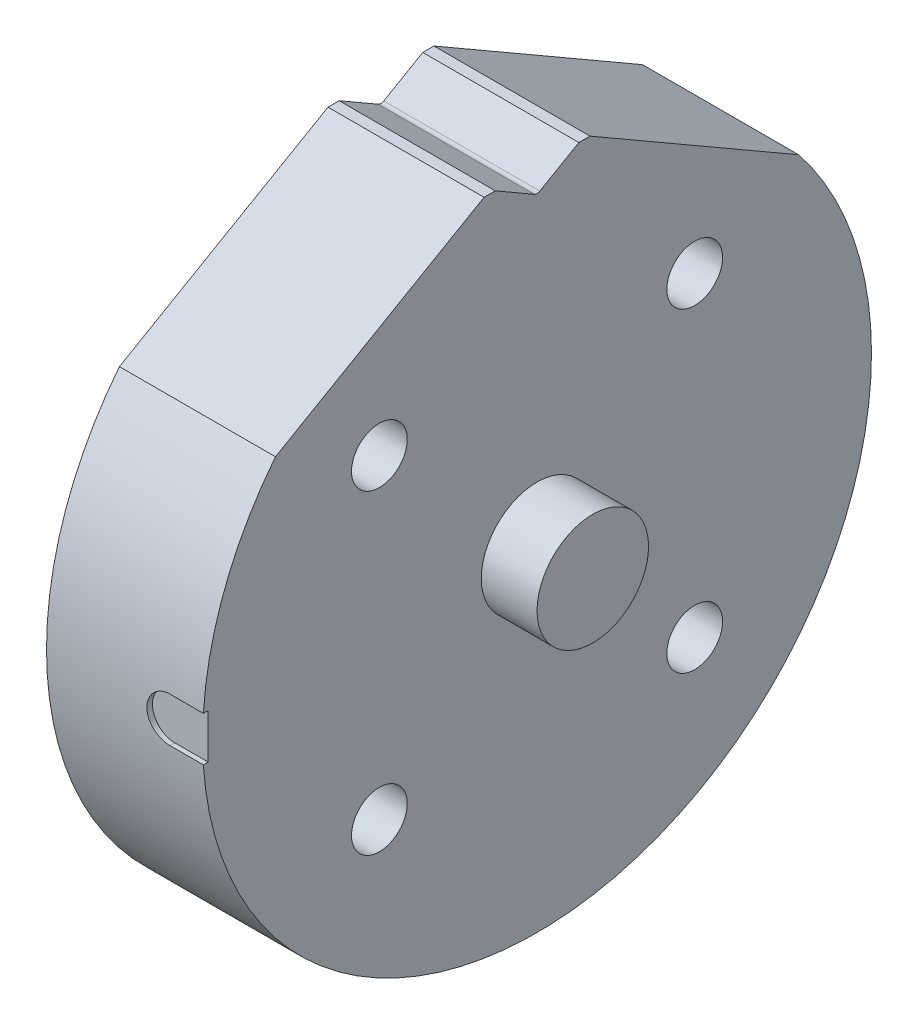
ISO-10303-21;
HEADER;
FILE_DESCRIPTION(('STEP AP214'),'2;1');
FILE_NAME('part.step','',(''),(''),'','','');
FILE_SCHEMA(('AUTOMOTIVE_DESIGN { 1 0 10303 214 1 1 1 1 }'));
ENDSEC;
DATA;
#1=APPLICATION_CONTEXT('core data for automotive mechanical design processes');
#2=APPLICATION_PROTOCOL_DEFINITION('international standard','automotive_design',2000,#1);
#3=PRODUCT_CONTEXT('',#1,'mechanical');
#4=PRODUCT('Part','Part','',(#3));
#5=PRODUCT_RELATED_PRODUCT_CATEGORY('part','',(#4));
#6=PRODUCT_DEFINITION_FORMATION('','',#4);
#7=PRODUCT_DEFINITION_CONTEXT('part definition',#1,'design');
#8=PRODUCT_DEFINITION('design','',#6,#7);
#9=PRODUCT_DEFINITION_SHAPE('','',#8);
#10=(LENGTH_UNIT() NAMED_UNIT(*) SI_UNIT(.MILLI.,.METRE.));
#11=(NAMED_UNIT(*) PLANE_ANGLE_UNIT() SI_UNIT($,.RADIAN.));
#12=(NAMED_UNIT(*) SI_UNIT($,.STERADIAN.) SOLID_ANGLE_UNIT());
#13=UNCERTAINTY_MEASURE_WITH_UNIT(LENGTH_MEASURE(1.E-05),#10,'distance_accuracy_value','');
#14=(GEOMETRIC_REPRESENTATION_CONTEXT(3) GLOBAL_UNCERTAINTY_ASSIGNED_CONTEXT((#13)) GLOBAL_UNIT_ASSIGNED_CONTEXT((#10,
#11,#12)) REPRESENTATION_CONTEXT('',''));
#15=CARTESIAN_POINT('',(0.,0.,0.));
#16=DIRECTION('',(0.,0.,1.));
#17=DIRECTION('',(1.,0.,0.));
#18=AXIS2_PLACEMENT_3D('',#15,#16,#17);
#19=CARTESIAN_POINT('',(-63.0638210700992,-1.66533453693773E-13,0.));
#20=DIRECTION('',(-1.,0.,0.));
#21=DIRECTION('',(0.,0.,1.));
#22=AXIS2_PLACEMENT_3D('',#19,#20,#21);
#23=CYLINDRICAL_SURFACE('',#22,30.);
#24=CARTESIAN_POINT('',(7.,-29.3938769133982,-6.));
#25=CARTESIAN_POINT('',(7.16674913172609,-29.3938750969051,-6.00000333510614));
#26=CARTESIAN_POINT('',(7.33345662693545,-29.3952984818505,-5.99304686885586));
#27=CARTESIAN_POINT('',(7.66571638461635,-29.4009458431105,-5.96528300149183));
#28=CARTESIAN_POINT('',(7.83126844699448,-29.4051702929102,-5.94447325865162));
#29=CARTESIAN_POINT('',(8.16005695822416,-29.416300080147,-5.88914931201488));
#30=CARTESIAN_POINT('',(8.32329215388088,-29.4232068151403,-5.85462796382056));
#31=CARTESIAN_POINT('',(8.64626671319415,-29.4395002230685,-5.77213943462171));
#32=CARTESIAN_POINT('',(8.80600476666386,-29.4488878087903,-5.72416730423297));
#33=CARTESIAN_POINT('',(9.12058736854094,-29.4698539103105,-5.61522748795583));
#34=CARTESIAN_POINT('',(9.27543836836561,-29.4814293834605,-5.55427783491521));
#35=CARTESIAN_POINT('',(9.5794756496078,-29.5064523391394,-5.41977382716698));
#36=CARTESIAN_POINT('',(9.72865981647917,-29.5199005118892,-5.34621482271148));
#37=CARTESIAN_POINT('',(10.0202360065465,-29.5482787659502,-5.18707511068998));
#38=CARTESIAN_POINT('',(10.1626310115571,-29.5632081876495,-5.1014997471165));
#39=CARTESIAN_POINT('',(10.4398093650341,-29.5941431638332,-4.91886856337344));
#40=CARTESIAN_POINT('',(10.5745898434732,-29.6101491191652,-4.82180845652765));
#41=CARTESIAN_POINT('',(10.8372071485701,-29.6429919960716,-4.61563131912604));
#42=CARTESIAN_POINT('',(10.9649379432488,-29.6598367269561,-4.50638045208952));
#43=CARTESIAN_POINT('',(11.210821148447,-29.6937060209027,-4.2775231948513));
#44=CARTESIAN_POINT('',(11.328969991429,-29.7107306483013,-4.15791298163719));
#45=CARTESIAN_POINT('',(11.5548035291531,-29.7444746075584,-3.90921587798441));
#46=CARTESIAN_POINT('',(11.66249130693,-29.7611940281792,-3.78013179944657));
#47=CARTESIAN_POINT('',(11.8667388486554,-29.7938748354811,-3.51327430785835));
#48=CARTESIAN_POINT('',(11.963294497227,-29.8098359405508,-3.37549771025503));
#49=CARTESIAN_POINT('',(12.1453111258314,-29.8406787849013,-3.09103878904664));
#50=CARTESIAN_POINT('',(12.2306724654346,-29.8555503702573,-2.94429156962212));
#51=CARTESIAN_POINT('',(12.3887417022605,-29.8836491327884,-2.64391411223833));
#52=CARTESIAN_POINT('',(12.4614448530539,-29.896875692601,-2.4902813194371));
#53=CARTESIAN_POINT('',(12.5935768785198,-29.9212946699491,-2.17731919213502));
#54=CARTESIAN_POINT('',(12.653011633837,-29.9324879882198,-2.01799241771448));
#55=CARTESIAN_POINT('',(12.7581991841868,-29.9525329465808,-1.69472460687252));
#56=CARTESIAN_POINT('',(12.8039470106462,-29.9613837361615,-1.5307819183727));
#57=CARTESIAN_POINT('',(12.9189772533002,-29.9838019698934,-1.03829197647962));
#58=CARTESIAN_POINT('',(12.9679482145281,-29.9935985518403,-0.704557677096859));
#59=CARTESIAN_POINT('',(13.0093233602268,-30.0018598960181,-0.0336601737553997));
#60=CARTESIAN_POINT('',(13.0017329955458,-30.0003257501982,0.303502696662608));
#61=CARTESIAN_POINT('',(12.9308382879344,-29.9862248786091,0.966838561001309));
#62=CARTESIAN_POINT('',(12.8683288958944,-29.973815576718,1.29309968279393));
#63=CARTESIAN_POINT('',(12.6906110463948,-29.9395309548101,1.93039336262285));
#64=CARTESIAN_POINT('',(12.5754004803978,-29.9176552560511,2.24142531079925));
#65=CARTESIAN_POINT('',(12.2948194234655,-29.8666376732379,2.84171580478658));
#66=CARTESIAN_POINT('',(12.1291374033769,-29.8374508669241,3.13082478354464));
#67=CARTESIAN_POINT('',(11.7525456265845,-29.7750281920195,3.67743053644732));
#68=CARTESIAN_POINT('',(11.5416306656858,-29.7417918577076,3.93492366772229));
#69=CARTESIAN_POINT('',(11.0761982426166,-29.6742578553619,4.41570851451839));
#70=CARTESIAN_POINT('',(10.8209848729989,-29.6399517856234,4.63832588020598));
#71=CARTESIAN_POINT('',(10.2765013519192,-29.5746942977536,5.03771097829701));
#72=CARTESIAN_POINT('',(9.98723055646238,-29.5437429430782,5.21447784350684));
#73=CARTESIAN_POINT('',(9.38187500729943,-29.488682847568,5.51737688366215));
#74=CARTESIAN_POINT('',(9.06573419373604,-29.4645888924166,5.6433998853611));
#75=CARTESIAN_POINT('',(8.41617205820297,-29.4261885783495,5.84034205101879));
#76=CARTESIAN_POINT('',(8.08275299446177,-29.4118809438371,5.91126839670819));
#77=CARTESIAN_POINT('',(7.41421085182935,-29.3949287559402,5.99499603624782));
#78=CARTESIAN_POINT('',(7.07921455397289,-29.3920888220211,6.00877115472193));
#79=CARTESIAN_POINT('',(6.41171066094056,-29.397869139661,5.98042576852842));
#80=CARTESIAN_POINT('',(6.07920292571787,-29.4064887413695,5.93830843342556));
#81=CARTESIAN_POINT('',(5.42938815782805,-29.4340339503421,5.80021325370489));
#82=CARTESIAN_POINT('',(5.11196594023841,-29.4528599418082,5.70475574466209));
#83=CARTESIAN_POINT('',(4.49762032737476,-29.4986093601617,5.46324619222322));
#84=CARTESIAN_POINT('',(4.20069862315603,-29.52553345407,5.31718998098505));
#85=CARTESIAN_POINT('',(3.63152133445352,-29.5848843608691,4.97642492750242));
#86=CARTESIAN_POINT('',(3.35963770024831,-29.6173783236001,4.78110674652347));
#87=CARTESIAN_POINT('',(2.85215014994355,-29.6840234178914,4.34817315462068));
#88=CARTESIAN_POINT('',(2.61654997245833,-29.7181747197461,4.11055339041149));
#89=CARTESIAN_POINT('',(2.18462456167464,-29.7849207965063,3.59539469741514));
#90=CARTESIAN_POINT('',(1.98895775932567,-29.8174836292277,3.31729896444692));
#91=CARTESIAN_POINT('',(1.64712502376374,-29.8768274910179,2.73160340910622));
#92=CARTESIAN_POINT('',(1.50095701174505,-29.9036087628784,2.42400482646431));
#93=CARTESIAN_POINT('',(1.26322560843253,-29.9482382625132,1.78983082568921));
#94=CARTESIAN_POINT('',(1.17135256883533,-29.9661370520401,1.46337490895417));
#95=CARTESIAN_POINT('',(1.04385683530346,-29.9911918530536,0.79908186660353));
#96=CARTESIAN_POINT('',(1.00822736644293,-29.9983491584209,0.461246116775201));
#97=CARTESIAN_POINT('',(0.997839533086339,-30.0004347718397,-0.0431170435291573));
#98=CARTESIAN_POINT('',(1.00134922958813,-29.9997291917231,-0.209457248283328));
#99=CARTESIAN_POINT('',(1.02215375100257,-29.9955746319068,-0.541221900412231));
#100=CARTESIAN_POINT('',(1.03944334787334,-29.9921266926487,-0.706646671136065));
#101=CARTESIAN_POINT('',(1.08768563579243,-29.9825768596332,-1.03545948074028));
#102=CARTESIAN_POINT('',(1.11864305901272,-29.9764740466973,-1.19884679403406));
#103=CARTESIAN_POINT('',(1.19396180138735,-29.9617875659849,-1.52232847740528));
#104=CARTESIAN_POINT('',(1.23831832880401,-29.9532047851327,-1.68242400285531));
#105=CARTESIAN_POINT('',(1.34000061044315,-29.9338121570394,-1.99795666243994));
#106=CARTESIAN_POINT('',(1.39730105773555,-29.9230066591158,-2.15340222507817));
#107=CARTESIAN_POINT('',(1.52446950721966,-29.8994570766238,-2.45884588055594));
#108=CARTESIAN_POINT('',(1.59433305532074,-29.8867136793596,-2.60884588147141));
#109=CARTESIAN_POINT('',(1.74616794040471,-29.8596244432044,-2.90251338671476));
#110=CARTESIAN_POINT('',(1.82814425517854,-29.8452779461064,-3.04617825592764));
#111=CARTESIAN_POINT('',(2.00357727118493,-29.815378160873,-3.32611433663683));
#112=CARTESIAN_POINT('',(2.09703002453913,-29.7998252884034,-3.46238806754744));
#113=CARTESIAN_POINT('',(2.2964353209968,-29.7676616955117,-3.72889132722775));
#114=CARTESIAN_POINT('',(2.4025687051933,-29.7510377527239,-3.85898398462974));
#115=CARTESIAN_POINT('',(2.6252936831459,-29.7174350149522,-4.10975159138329));
#116=CARTESIAN_POINT('',(2.74188158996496,-29.7004563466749,-4.23042983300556));
#117=CARTESIAN_POINT('',(2.98483296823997,-29.6665989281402,-4.46167854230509));
#118=CARTESIAN_POINT('',(3.11120224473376,-29.6497202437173,-4.57224292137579));
#119=CARTESIAN_POINT('',(3.3727587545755,-29.6165504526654,-4.78239003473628));
#120=CARTESIAN_POINT('',(3.50794273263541,-29.6002591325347,-4.88197678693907));
#121=CARTESIAN_POINT('',(3.78782227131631,-29.5685397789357,-5.07057246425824));
#122=CARTESIAN_POINT('',(3.93260724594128,-29.5531234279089,-5.15945073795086));
#123=CARTESIAN_POINT('',(4.22925354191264,-29.5238083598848,-5.32463866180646));
#124=CARTESIAN_POINT('',(4.38111222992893,-29.5099090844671,-5.40095294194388));
#125=CARTESIAN_POINT('',(4.69080533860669,-29.4840397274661,-5.54043652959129));
#126=CARTESIAN_POINT('',(4.84863604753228,-29.4720684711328,-5.60361384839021));
#127=CARTESIAN_POINT('',(5.1691767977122,-29.4504044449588,-5.71637667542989));
#128=CARTESIAN_POINT('',(5.33188588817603,-29.4407112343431,-5.76596481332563));
#129=CARTESIAN_POINT('',(5.74146122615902,-29.4197929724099,-5.87197100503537));
#130=CARTESIAN_POINT('',(5.99065354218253,-29.4101281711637,-5.91991604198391));
#131=CARTESIAN_POINT('',(6.49326270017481,-29.3971716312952,-5.98392745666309));
#132=CARTESIAN_POINT('',(6.74667939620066,-29.3938796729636,-5.9999949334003));
#133=CARTESIAN_POINT('',(7.,-29.3938769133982,-6.));
#134=B_SPLINE_CURVE_WITH_KNOTS('',3,(#24,#25,#26,#27,#28,#29,#30,#31,#32,#33,#34,#35,#36,#37,
#38,#39,#40,#41,#42,#43,#44,#45,#46,#47,#48,#49,#50,#51,#52,#53,#54,#55,#56,#57,#58,#59,#60,#61,
#62,#63,#64,#65,#66,#67,#68,#69,#70,#71,#72,#73,#74,#75,#76,#77,#78,#79,#80,#81,#82,#83,#84,#85,
#86,#87,#88,#89,#90,#91,#92,#93,#94,#95,#96,#97,#98,#99,#100,#101,#102,#103,#104,#105,#106,#107,
#108,#109,#110,#111,#112,#113,#114,#115,#116,#117,#118,#119,#120,#121,#122,#123,#124,#125,#126,
#127,#128,#129,#130,#131,#132,#133),.UNSPECIFIED.,.T.,.F.,(4,2,2,2,2,2,2,2,2,2,2,2,2,2,2,2,2,2,
2,2,2,2,2,2,2,2,2,2,2,2,2,2,2,2,2,2,2,2,2,2,2,2,2,2,2,2,2,2,2,2,2,2,2,2,4),(0.,
0.500024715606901,1.00013397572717,1.50050415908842,2.001058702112,2.50092218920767,
3.00097040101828,3.50079692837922,4.00081060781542,4.50698586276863,5.01334871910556,
5.51956188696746,6.02596159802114,6.53660041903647,7.04743030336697,7.55803333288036,
8.06882149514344,9.07582433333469,10.0827301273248,11.0752967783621,12.0679031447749,
13.066764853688,14.0657415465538,15.0821302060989,16.0985380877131,17.1171211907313,
18.1355715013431,19.1365948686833,20.1375614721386,21.1289299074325,22.1203800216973,
23.1247529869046,24.1292293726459,25.1491255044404,26.1689787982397,27.1829582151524,
28.1968154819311,28.6954646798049,29.1939247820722,29.6925576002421,30.1910123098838,
30.6885007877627,31.185813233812,31.683330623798,32.1806773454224,32.6862322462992,
33.1916095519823,33.697289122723,34.2027829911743,34.7139260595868,35.2248803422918,
35.7355221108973,36.2460649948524,37.0057147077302,37.7653382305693),.UNSPECIFIED.);
#135=CARTESIAN_POINT('',(7.,-29.3938769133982,-6.));
#136=VERTEX_POINT('',#135);
#137=EDGE_CURVE('E158',#136,#136,#134,.T.);
#138=ORIENTED_EDGE('',*,*,#137,.F.);
#139=EDGE_LOOP('',(#138));
#140=FACE_BOUND('',#139,.T.);
#141=DIRECTION('',(-1.,0.,0.));
#142=VECTOR('',#141,1.);
#143=CARTESIAN_POINT('',(-63.0638210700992,2.00000000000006,29.9332590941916));
#144=LINE('',#143,#142);
#145=CARTESIAN_POINT('',(14.,2.00000000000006,29.9332590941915));
#146=VERTEX_POINT('',#145);
#147=CARTESIAN_POINT('',(11.,2.00000000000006,29.9332590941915));
#148=VERTEX_POINT('',#147);
#149=EDGE_CURVE('E607',#146,#148,#144,.T.);
#150=ORIENTED_EDGE('',*,*,#149,.F.);
#151=CARTESIAN_POINT('',(14.,0.,0.));
#152=DIRECTION('',(-1.,0.,0.));
#153=DIRECTION('',(0.,0.,1.));
#154=AXIS2_PLACEMENT_3D('',#151,#152,#153);
#155=CIRCLE('',#154,30.);
#156=CARTESIAN_POINT('',(14.,18.6972851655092,23.4608509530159));
#157=VERTEX_POINT('',#156);
#158=EDGE_CURVE('E150',#146,#157,#155,.T.);
#159=ORIENTED_EDGE('',*,*,#158,.T.);
#160=DIRECTION('',(-1.,0.,0.));
#161=VECTOR('',#160,1.);
#162=CARTESIAN_POINT('',(19.,18.6972851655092,23.4608509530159));
#163=LINE('',#162,#161);
#164=CARTESIAN_POINT('',(0.,18.6972851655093,23.4608509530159));
#165=VERTEX_POINT('',#164);
#166=EDGE_CURVE('E546',#157,#165,#163,.T.);
#167=ORIENTED_EDGE('',*,*,#166,.T.);
#168=CARTESIAN_POINT('',(0.,0.,0.));
#169=DIRECTION('',(-1.,0.,0.));
#170=DIRECTION('',(0.,0.,1.));
#171=AXIS2_PLACEMENT_3D('',#168,#169,#170);
#172=CIRCLE('',#171,30.);
#173=CARTESIAN_POINT('',(0.,18.6972851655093,-23.460850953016));
#174=VERTEX_POINT('',#173);
#175=EDGE_CURVE('E580',#174,#165,#172,.T.);
#176=ORIENTED_EDGE('',*,*,#175,.F.);
#177=DIRECTION('',(-1.,0.,0.));
#178=VECTOR('',#177,1.);
#179=CARTESIAN_POINT('',(19.,18.6972851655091,-23.460850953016));
#180=LINE('',#179,#178);
#181=CARTESIAN_POINT('',(14.,18.6972851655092,-23.460850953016));
#182=VERTEX_POINT('',#181);
#183=EDGE_CURVE('E544',#182,#174,#180,.T.);
#184=ORIENTED_EDGE('',*,*,#183,.F.);
#185=CARTESIAN_POINT('',(14.,-1.99999999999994,29.9332590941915));
#186=VERTEX_POINT('',#185);
#187=EDGE_CURVE('E576',#182,#186,#155,.T.);
#188=ORIENTED_EDGE('',*,*,#187,.T.);
#189=DIRECTION('',(-1.,0.,0.));
#190=VECTOR('',#189,1.);
#191=CARTESIAN_POINT('',(-63.0638210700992,-1.99999999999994,29.9332590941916));
#192=LINE('',#191,#190);
#193=CARTESIAN_POINT('',(11.,-2.00000000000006,29.9332590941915));
#194=VERTEX_POINT('',#193);
#195=EDGE_CURVE('E604',#194,#186,#192,.F.);
#196=ORIENTED_EDGE('',*,*,#195,.F.);
#197=CARTESIAN_POINT('',(11.,2.00000000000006,29.9332590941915));
#198=CARTESIAN_POINT('',(10.9437983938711,1.99999970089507,29.9332582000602));
#199=CARTESIAN_POINT('',(10.887623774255,1.99762954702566,29.933417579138));
#200=CARTESIAN_POINT('',(10.7756777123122,1.98817452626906,29.9340474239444));
#201=CARTESIAN_POINT('',(10.7199062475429,1.98108992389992,29.9345178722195));
#202=CARTESIAN_POINT('',(10.5538977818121,1.95283335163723,29.9363795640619));
#203=CARTESIAN_POINT('',(10.4447747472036,1.9246584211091,29.9382212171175));
#204=CARTESIAN_POINT('',(10.2328253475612,1.85042548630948,29.9429005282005));
#205=CARTESIAN_POINT('',(10.1300016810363,1.80435987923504,29.9457386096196));
#206=CARTESIAN_POINT('',(9.93354771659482,1.69566284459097,29.952089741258));
#207=CARTESIAN_POINT('',(9.83991592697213,1.63303411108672,29.9556026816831));
#208=CARTESIAN_POINT('',(9.66435747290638,1.49288155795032,29.9629140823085));
#209=CARTESIAN_POINT('',(9.58244746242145,1.41533690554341,29.9667129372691));
#210=CARTESIAN_POINT('',(9.43278454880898,1.24758631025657,29.9741649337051));
#211=CARTESIAN_POINT('',(9.36503380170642,1.1573784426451,29.977818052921));
#212=CARTESIAN_POINT('',(9.24557220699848,0.966770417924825,29.9845700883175));
#213=CARTESIAN_POINT('',(9.1938757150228,0.866361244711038,29.9876685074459));
#214=CARTESIAN_POINT('',(9.1080845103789,0.658270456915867,29.9929575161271));
#215=CARTESIAN_POINT('',(9.0739885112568,0.55058937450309,29.9951481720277));
#216=CARTESIAN_POINT('',(9.02441034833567,0.331175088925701,29.9983722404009));
#217=CARTESIAN_POINT('',(9.00890066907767,0.219448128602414,29.9994073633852));
#218=CARTESIAN_POINT('',(8.99685032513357,-0.00503059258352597,30.0002095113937));
#219=CARTESIAN_POINT('',(9.00030988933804,-0.117782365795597,29.9999765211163));
#220=CARTESIAN_POINT('',(9.02607783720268,-0.340917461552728,29.9982700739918));
#221=CARTESIAN_POINT('',(9.04835606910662,-0.451304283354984,29.9967986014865));
#222=CARTESIAN_POINT('',(9.11108207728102,-0.66676756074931,29.9927831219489));
#223=CARTESIAN_POINT('',(9.151529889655,-0.771844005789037,29.9902391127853));
#224=CARTESIAN_POINT('',(9.24948184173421,-0.973802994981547,29.9843614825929));
#225=CARTESIAN_POINT('',(9.30699997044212,-1.07067873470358,29.9810272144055));
#226=CARTESIAN_POINT('',(9.43744697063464,-1.25340695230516,29.9739444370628));
#227=CARTESIAN_POINT('',(9.51037531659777,-1.3392598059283,29.9701959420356));
#228=CARTESIAN_POINT('',(9.66973090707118,-1.49767500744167,29.9626982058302));
#229=CARTESIAN_POINT('',(9.75618239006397,-1.57021297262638,29.9589489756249));
#230=CARTESIAN_POINT('',(9.94008289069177,-1.69977270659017,29.9518780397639));
#231=CARTESIAN_POINT('',(10.0375353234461,-1.7567896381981,29.9485564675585));
#232=CARTESIAN_POINT('',(10.2406997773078,-1.85368479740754,29.9427156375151));
#233=CARTESIAN_POINT('',(10.3464172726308,-1.8935515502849,29.9401969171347));
#234=CARTESIAN_POINT('',(10.5629849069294,-1.95490222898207,29.9362542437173));
#235=CARTESIAN_POINT('',(10.6738269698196,-1.97641410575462,29.934828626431));
#236=CARTESIAN_POINT('',(10.8211859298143,-1.99231485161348,29.9337716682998));
#237=CARTESIAN_POINT('',(10.8569192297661,-1.99519826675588,29.9335795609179));
#238=CARTESIAN_POINT('',(10.9284301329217,-1.99903822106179,29.9333234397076));
#239=CARTESIAN_POINT('',(10.9642075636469,-1.99999795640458,29.933259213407));
#240=CARTESIAN_POINT('',(11.,-2.00000000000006,29.9332590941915));
#241=B_SPLINE_CURVE_WITH_KNOTS('',3,(#197,#198,#199,#200,#201,#202,#203,#204,#205,#206,#207,
#208,#209,#210,#211,#212,#213,#214,#215,#216,#217,#218,#219,#220,#221,#222,#223,#224,#225,#226,
#227,#228,#229,#230,#231,#232,#233,#234,#235,#236,#237,#238,#239,#240),.UNSPECIFIED.,.F.,.F.,(4,
2,2,2,2,2,2,2,2,2,2,2,2,2,2,2,2,2,2,2,2,4),(0.,0.168501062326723,0.336992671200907,
0.673407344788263,1.0099651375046,1.34646822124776,1.68344475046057,2.02047255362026,
2.35780086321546,2.69510451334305,3.03190819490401,3.36871594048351,3.70498506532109,
4.04125485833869,4.37780098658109,4.71433563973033,5.05148054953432,5.38873041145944,
5.72620556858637,6.06316589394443,6.1706790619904,6.27801344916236),.UNSPECIFIED.);
#242=EDGE_CURVE('E11',#148,#194,#241,.T.);
#243=ORIENTED_EDGE('',*,*,#242,.F.);
#244=EDGE_LOOP('',(#150,#159,#167,#176,#184,#188,#196,#243));
#245=FACE_BOUND('',#244,.T.);
#246=ADVANCED_FACE('F16',(#140,#245),#23,.T.);
#247=CARTESIAN_POINT('',(14.,0.,-30.));
#248=DIRECTION('',(-1.,0.,0.));
#249=DIRECTION('',(0.,0.,1.));
#250=AXIS2_PLACEMENT_3D('',#247,#248,#249);
#251=PLANE('',#250);
#252=CARTESIAN_POINT('',(14.,0.,0.));
#253=DIRECTION('',(-1.,0.,0.));
#254=DIRECTION('',(0.,0.,1.));
#255=AXIS2_PLACEMENT_3D('',#252,#253,#254);
#256=CIRCLE('',#255,5.);
#257=CARTESIAN_POINT('',(14.,0.,4.99999999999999));
#258=VERTEX_POINT('',#257);
#259=EDGE_CURVE('E246',#258,#258,#256,.T.);
#260=ORIENTED_EDGE('',*,*,#259,.T.);
#261=EDGE_LOOP('',(#260));
#262=FACE_BOUND('',#261,.T.);
#263=CARTESIAN_POINT('',(14.,14.142135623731,14.142135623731));
#264=DIRECTION('',(-1.,0.,0.));
#265=DIRECTION('',(0.,0.,1.));
#266=AXIS2_PLACEMENT_3D('',#263,#264,#265);
#267=CIRCLE('',#266,2.5);
#268=CARTESIAN_POINT('',(14.,14.142135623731,16.642135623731));
#269=VERTEX_POINT('',#268);
#270=EDGE_CURVE('E250',#269,#269,#267,.T.);
#271=ORIENTED_EDGE('',*,*,#270,.T.);
#272=EDGE_LOOP('',(#271));
#273=FACE_BOUND('',#272,.T.);
#274=CARTESIAN_POINT('',(14.,-14.1421356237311,14.1421356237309));
#275=DIRECTION('',(-1.,0.,0.));
#276=DIRECTION('',(0.,0.,1.));
#277=AXIS2_PLACEMENT_3D('',#274,#275,#276);
#278=CIRCLE('',#277,2.5);
#279=CARTESIAN_POINT('',(14.,-14.1421356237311,16.6421356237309));
#280=VERTEX_POINT('',#279);
#281=EDGE_CURVE('E254',#280,#280,#278,.T.);
#282=ORIENTED_EDGE('',*,*,#281,.T.);
#283=EDGE_LOOP('',(#282));
#284=FACE_BOUND('',#283,.T.);
#285=CARTESIAN_POINT('',(14.,-14.1421356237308,-14.1421356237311));
#286=DIRECTION('',(-1.,0.,0.));
#287=DIRECTION('',(0.,0.,1.));
#288=AXIS2_PLACEMENT_3D('',#285,#286,#287);
#289=CIRCLE('',#288,2.5);
#290=CARTESIAN_POINT('',(14.,-14.1421356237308,-11.6421356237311));
#291=VERTEX_POINT('',#290);
#292=EDGE_CURVE('E258',#291,#291,#289,.T.);
#293=ORIENTED_EDGE('',*,*,#292,.T.);
#294=EDGE_LOOP('',(#293));
#295=FACE_BOUND('',#294,.T.);
#296=CARTESIAN_POINT('',(14.,14.1421356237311,-14.1421356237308));
#297=DIRECTION('',(-1.,0.,0.));
#298=DIRECTION('',(0.,0.,1.));
#299=AXIS2_PLACEMENT_3D('',#296,#297,#298);
#300=CIRCLE('',#299,2.5);
#301=CARTESIAN_POINT('',(14.,14.1421356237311,-11.6421356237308));
#302=VERTEX_POINT('',#301);
#303=EDGE_CURVE('E261',#302,#302,#300,.T.);
#304=ORIENTED_EDGE('',*,*,#303,.T.);
#305=EDGE_LOOP('',(#304));
#306=FACE_BOUND('',#305,.T.);
#307=DIRECTION('',(0.,0.,1.));
#308=VECTOR('',#307,1.);
#309=CARTESIAN_POINT('',(14.,1.99999999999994,-30.));
#310=LINE('',#309,#308);
#311=CARTESIAN_POINT('',(14.,2.00000000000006,29.5));
#312=VERTEX_POINT('',#311);
#313=EDGE_CURVE('E30',#312,#146,#310,.T.);
#314=ORIENTED_EDGE('',*,*,#313,.F.);
#315=DIRECTION('',(0.,1.,0.));
#316=VECTOR('',#315,1.);
#317=CARTESIAN_POINT('',(14.,2.00000000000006,29.5));
#318=LINE('',#317,#316);
#319=CARTESIAN_POINT('',(14.,-1.99999999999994,29.5));
#320=VERTEX_POINT('',#319);
#321=EDGE_CURVE('E139',#320,#312,#318,.T.);
#322=ORIENTED_EDGE('',*,*,#321,.F.);
#323=DIRECTION('',(0.,0.,-1.));
#324=VECTOR('',#323,1.);
#325=CARTESIAN_POINT('',(14.,-2.,-30.));
#326=LINE('',#325,#324);
#327=EDGE_CURVE('E152',#186,#320,#326,.T.);
#328=ORIENTED_EDGE('',*,*,#327,.F.);
#329=ORIENTED_EDGE('',*,*,#187,.F.);
#330=DIRECTION('',(0.,0.5,0.866025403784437));
#331=VECTOR('',#330,1.);
#332=CARTESIAN_POINT('',(14.,11.1914292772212,-36.4613747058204));
#333=LINE('',#332,#331);
#334=CARTESIAN_POINT('',(14.,29.5,-4.75));
#335=VERTEX_POINT('',#334);
#336=EDGE_CURVE('E289',#182,#335,#333,.T.);
#337=ORIENTED_EDGE('',*,*,#336,.T.);
#338=DIRECTION('',(0.,0.,1.));
#339=VECTOR('',#338,1.);
#340=CARTESIAN_POINT('',(14.,29.5,-30.));
#341=LINE('',#340,#339);
#342=CARTESIAN_POINT('',(14.,29.5,-3.75));
#343=VERTEX_POINT('',#342);
#344=EDGE_CURVE('E286',#335,#343,#341,.T.);
#345=ORIENTED_EDGE('',*,*,#344,.T.);
#346=DIRECTION('',(0.,-0.5,0.866025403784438));
#347=VECTOR('',#346,1.);
#348=CARTESIAN_POINT('',(14.,33.4915834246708,-10.6636252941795));
#349=LINE('',#348,#347);
#350=CARTESIAN_POINT('',(14.,27.4792740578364,-0.250000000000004));
#351=VERTEX_POINT('',#350);
#352=EDGE_CURVE('E275',#343,#351,#349,.T.);
#353=ORIENTED_EDGE('',*,*,#352,.T.);
#354=CARTESIAN_POINT('',(14.,27.9122867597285,0.));
#355=DIRECTION('',(-1.,0.,0.));
#356=DIRECTION('',(0.,0.,1.));
#357=AXIS2_PLACEMENT_3D('',#354,#355,#356);
#358=CIRCLE('',#357,0.5);
#359=CARTESIAN_POINT('',(14.,27.4792740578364,0.250000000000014));
#360=VERTEX_POINT('',#359);
#361=EDGE_CURVE('E155',#351,#360,#358,.T.);
#362=ORIENTED_EDGE('',*,*,#361,.T.);
#363=DIRECTION('',(0.,0.5,0.866025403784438));
#364=VECTOR('',#363,1.);
#365=CARTESIAN_POINT('',(14.,7.51082131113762,-34.3363747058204));
#366=LINE('',#365,#364);
#367=CARTESIAN_POINT('',(14.,29.5,3.75));
#368=VERTEX_POINT('',#367);
#369=EDGE_CURVE('E277',#360,#368,#366,.T.);
#370=ORIENTED_EDGE('',*,*,#369,.T.);
#371=DIRECTION('',(0.,0.,1.));
#372=VECTOR('',#371,1.);
#373=CARTESIAN_POINT('',(14.,29.5,-30.));
#374=LINE('',#373,#372);
#375=CARTESIAN_POINT('',(14.,29.5,4.75));
#376=VERTEX_POINT('',#375);
#377=EDGE_CURVE('E280',#368,#376,#374,.T.);
#378=ORIENTED_EDGE('',*,*,#377,.T.);
#379=DIRECTION('',(0.,-0.5,0.866025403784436));
#380=VECTOR('',#379,1.);
#381=CARTESIAN_POINT('',(14.,37.1721913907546,-8.53862529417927));
#382=LINE('',#381,#380);
#383=EDGE_CURVE('E283',#376,#157,#382,.T.);
#384=ORIENTED_EDGE('',*,*,#383,.T.);
#385=ORIENTED_EDGE('',*,*,#158,.F.);
#386=EDGE_LOOP('',(#314,#322,#328,#329,#337,#345,#353,#362,#370,#378,#384,#385));
#387=FACE_BOUND('',#386,.T.);
#388=ADVANCED_FACE('F148',(#262,#273,#284,#295,#306,#387),#251,.F.);
#389=CARTESIAN_POINT('',(6.,0.,0.));
#390=DIRECTION('',(1.,0.,0.));
#391=DIRECTION('',(0.,0.,-1.));
#392=AXIS2_PLACEMENT_3D('',#389,#390,#391);
#393=PLANE('',#392);
#394=CARTESIAN_POINT('',(6.,0.,0.));
#395=DIRECTION('',(-1.,0.,0.));
#396=DIRECTION('',(0.,0.,1.));
#397=AXIS2_PLACEMENT_3D('',#394,#395,#396);
#398=CIRCLE('',#397,12.5);
#399=CARTESIAN_POINT('',(6.,0.,12.5));
#400=VERTEX_POINT('',#399);
#401=EDGE_CURVE('E278',#400,#400,#398,.T.);
#402=ORIENTED_EDGE('',*,*,#401,.T.);
#403=EDGE_LOOP('',(#402));
#404=FACE_BOUND('',#403,.T.);
#405=ADVANCED_FACE('F234',(#404),#393,.F.);
#406=CARTESIAN_POINT('',(-63.0638210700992,-1.66533453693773E-13,0.));
#407=DIRECTION('',(-1.,0.,0.));
#408=DIRECTION('',(0.,0.,1.));
#409=AXIS2_PLACEMENT_3D('',#406,#407,#408);
#410=CYLINDRICAL_SURFACE('',#409,12.5);
#411=ORIENTED_EDGE('',*,*,#401,.F.);
#412=EDGE_LOOP('',(#411));
#413=FACE_BOUND('',#412,.T.);
#414=CARTESIAN_POINT('',(0.,0.,0.));
#415=DIRECTION('',(-1.,0.,0.));
#416=DIRECTION('',(0.,0.,1.));
#417=AXIS2_PLACEMENT_3D('',#414,#415,#416);
#418=CIRCLE('',#417,12.5);
#419=CARTESIAN_POINT('',(0.,0.,12.5));
#420=VERTEX_POINT('',#419);
#421=EDGE_CURVE('E584',#420,#420,#418,.T.);
#422=ORIENTED_EDGE('',*,*,#421,.T.);
#423=EDGE_LOOP('',(#422));
#424=FACE_BOUND('',#423,.T.);
#425=ADVANCED_FACE('F239',(#413,#424),#410,.F.);
#426=CARTESIAN_POINT('',(0.,0.,-12.5));
#427=DIRECTION('',(1.,0.,0.));
#428=DIRECTION('',(0.,0.,-1.));
#429=AXIS2_PLACEMENT_3D('',#426,#427,#428);
#430=PLANE('',#429);
#431=CARTESIAN_POINT('',(0.,14.1421356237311,-14.1421356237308));
#432=DIRECTION('',(-1.,0.,0.));
#433=DIRECTION('',(0.,0.,1.));
#434=AXIS2_PLACEMENT_3D('',#431,#432,#433);
#435=CIRCLE('',#434,2.5);
#436=CARTESIAN_POINT('',(0.,14.1421356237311,-11.6421356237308));
#437=VERTEX_POINT('',#436);
#438=EDGE_CURVE('E264',#437,#437,#435,.T.);
#439=ORIENTED_EDGE('',*,*,#438,.F.);
#440=EDGE_LOOP('',(#439));
#441=FACE_BOUND('',#440,.T.);
#442=CARTESIAN_POINT('',(0.,-14.1421356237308,-14.1421356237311));
#443=DIRECTION('',(-1.,0.,0.));
#444=DIRECTION('',(0.,0.,1.));
#445=AXIS2_PLACEMENT_3D('',#442,#443,#444);
#446=CIRCLE('',#445,2.5);
#447=CARTESIAN_POINT('',(0.,-14.1421356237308,-11.6421356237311));
#448=VERTEX_POINT('',#447);
#449=EDGE_CURVE('E263',#448,#448,#446,.T.);
#450=ORIENTED_EDGE('',*,*,#449,.F.);
#451=EDGE_LOOP('',(#450));
#452=FACE_BOUND('',#451,.T.);
#453=CARTESIAN_POINT('',(0.,-14.1421356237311,14.1421356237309));
#454=DIRECTION('',(-1.,0.,0.));
#455=DIRECTION('',(0.,0.,1.));
#456=AXIS2_PLACEMENT_3D('',#453,#454,#455);
#457=CIRCLE('',#456,2.5);
#458=CARTESIAN_POINT('',(0.,-14.1421356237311,16.6421356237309));
#459=VERTEX_POINT('',#458);
#460=EDGE_CURVE('E556',#459,#459,#457,.T.);
#461=ORIENTED_EDGE('',*,*,#460,.F.);
#462=EDGE_LOOP('',(#461));
#463=FACE_BOUND('',#462,.T.);
#464=CARTESIAN_POINT('',(0.,14.142135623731,14.142135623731));
#465=DIRECTION('',(-1.,0.,0.));
#466=DIRECTION('',(0.,0.,1.));
#467=AXIS2_PLACEMENT_3D('',#464,#465,#466);
#468=CIRCLE('',#467,2.5);
#469=CARTESIAN_POINT('',(0.,14.142135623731,16.642135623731));
#470=VERTEX_POINT('',#469);
#471=EDGE_CURVE('E561',#470,#470,#468,.T.);
#472=ORIENTED_EDGE('',*,*,#471,.F.);
#473=EDGE_LOOP('',(#472));
#474=FACE_BOUND('',#473,.T.);
#475=CARTESIAN_POINT('',(0.,20.,0.));
#476=DIRECTION('',(-1.,0.,0.));
#477=DIRECTION('',(0.,0.,1.));
#478=AXIS2_PLACEMENT_3D('',#475,#476,#477);
#479=CIRCLE('',#478,3.);
#480=CARTESIAN_POINT('',(0.,20.,3.));
#481=VERTEX_POINT('',#480);
#482=EDGE_CURVE('E564',#481,#481,#479,.T.);
#483=ORIENTED_EDGE('',*,*,#482,.F.);
#484=EDGE_LOOP('',(#483));
#485=FACE_BOUND('',#484,.T.);
#486=ORIENTED_EDGE('',*,*,#421,.F.);
#487=EDGE_LOOP('',(#486));
#488=FACE_BOUND('',#487,.T.);
#489=DIRECTION('',(0.,0.,1.));
#490=VECTOR('',#489,1.);
#491=CARTESIAN_POINT('',(0.,29.5,-4.75));
#492=LINE('',#491,#490);
#493=CARTESIAN_POINT('',(0.,29.5,-4.75));
#494=VERTEX_POINT('',#493);
#495=CARTESIAN_POINT('',(0.,29.5,-3.75));
#496=VERTEX_POINT('',#495);
#497=EDGE_CURVE('E164',#494,#496,#492,.T.);
#498=ORIENTED_EDGE('',*,*,#497,.F.);
#499=DIRECTION('',(0.,0.5,0.866025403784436));
#500=VECTOR('',#499,1.);
#501=CARTESIAN_POINT('',(0.,18.6972851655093,-23.460850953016));
#502=LINE('',#501,#500);
#503=EDGE_CURVE('E539',#174,#494,#502,.T.);
#504=ORIENTED_EDGE('',*,*,#503,.F.);
#505=ORIENTED_EDGE('',*,*,#175,.T.);
#506=DIRECTION('',(0.,-0.5,0.866025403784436));
#507=VECTOR('',#506,1.);
#508=CARTESIAN_POINT('',(0.,29.5,4.75));
#509=LINE('',#508,#507);
#510=CARTESIAN_POINT('',(0.,29.5,4.75));
#511=VERTEX_POINT('',#510);
#512=EDGE_CURVE('E537',#511,#165,#509,.T.);
#513=ORIENTED_EDGE('',*,*,#512,.F.);
#514=DIRECTION('',(0.,0.,1.));
#515=VECTOR('',#514,1.);
#516=CARTESIAN_POINT('',(0.,29.5,3.75));
#517=LINE('',#516,#515);
#518=CARTESIAN_POINT('',(0.,29.5,3.75));
#519=VERTEX_POINT('',#518);
#520=EDGE_CURVE('E534',#519,#511,#517,.T.);
#521=ORIENTED_EDGE('',*,*,#520,.F.);
#522=DIRECTION('',(0.,0.5,0.866025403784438));
#523=VECTOR('',#522,1.);
#524=CARTESIAN_POINT('',(0.,27.3349364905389,0.));
#525=LINE('',#524,#523);
#526=CARTESIAN_POINT('',(0.,27.4792740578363,0.25));
#527=VERTEX_POINT('',#526);
#528=EDGE_CURVE('E532',#527,#519,#525,.T.);
#529=ORIENTED_EDGE('',*,*,#528,.F.);
#530=CARTESIAN_POINT('',(0.,27.9122867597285,0.));
#531=DIRECTION('',(1.,0.,0.));
#532=DIRECTION('',(0.,0.,-1.));
#533=AXIS2_PLACEMENT_3D('',#530,#531,#532);
#534=CIRCLE('',#533,0.5);
#535=CARTESIAN_POINT('',(0.,27.4792740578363,-0.25));
#536=VERTEX_POINT('',#535);
#537=EDGE_CURVE('E295',#527,#536,#534,.T.);
#538=ORIENTED_EDGE('',*,*,#537,.T.);
#539=DIRECTION('',(0.,-0.5,0.866025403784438));
#540=VECTOR('',#539,1.);
#541=CARTESIAN_POINT('',(0.,29.5,-3.75));
#542=LINE('',#541,#540);
#543=EDGE_CURVE('E530',#496,#536,#542,.T.);
#544=ORIENTED_EDGE('',*,*,#543,.F.);
#545=EDGE_LOOP('',(#498,#504,#505,#513,#521,#529,#538,#544));
#546=FACE_BOUND('',#545,.T.);
#547=ADVANCED_FACE('F231',(#441,#452,#463,#474,#485,#488,#546),#430,.F.);
#548=CARTESIAN_POINT('',(-63.0638210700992,-1.66533453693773E-13,0.));
#549=DIRECTION('',(-1.,0.,0.));
#550=DIRECTION('',(0.,0.,1.));
#551=AXIS2_PLACEMENT_3D('',#548,#549,#550);
#552=CYLINDRICAL_SURFACE('',#551,5.);
#553=ORIENTED_EDGE('',*,*,#259,.F.);
#554=EDGE_LOOP('',(#553));
#555=FACE_BOUND('',#554,.T.);
#556=CARTESIAN_POINT('',(19.,0.,0.));
#557=DIRECTION('',(-1.,0.,0.));
#558=DIRECTION('',(0.,0.,1.));
#559=AXIS2_PLACEMENT_3D('',#556,#557,#558);
#560=CIRCLE('',#559,5.);
#561=CARTESIAN_POINT('',(19.,0.,4.99999999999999));
#562=VERTEX_POINT('',#561);
#563=EDGE_CURVE('E570',#562,#562,#560,.T.);
#564=ORIENTED_EDGE('',*,*,#563,.T.);
#565=EDGE_LOOP('',(#564));
#566=FACE_BOUND('',#565,.T.);
#567=ADVANCED_FACE('F228',(#555,#566),#552,.T.);
#568=CARTESIAN_POINT('',(19.,0.,-5.));
#569=DIRECTION('',(-1.,0.,0.));
#570=DIRECTION('',(0.,0.,1.));
#571=AXIS2_PLACEMENT_3D('',#568,#569,#570);
#572=PLANE('',#571);
#573=ORIENTED_EDGE('',*,*,#563,.F.);
#574=EDGE_LOOP('',(#573));
#575=FACE_BOUND('',#574,.T.);
#576=ADVANCED_FACE('F224',(#575),#572,.F.);
#577=CARTESIAN_POINT('',(10.,20.,0.));
#578=DIRECTION('',(-1.,0.,0.));
#579=DIRECTION('',(0.,0.,1.));
#580=AXIS2_PLACEMENT_3D('',#577,#578,#579);
#581=CONICAL_SURFACE('',#580,3.,1.02974425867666);
#582=CARTESIAN_POINT('',(11.8025818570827,20.,0.));
#583=VERTEX_POINT('',#582);
#584=VERTEX_LOOP('',#583);
#585=FACE_BOUND('',#584,.T.);
#586=CARTESIAN_POINT('',(10.,20.,0.));
#587=DIRECTION('',(-1.,0.,0.));
#588=DIRECTION('',(0.,0.,1.));
#589=AXIS2_PLACEMENT_3D('',#586,#587,#588);
#590=CIRCLE('',#589,3.);
#591=CARTESIAN_POINT('',(10.,20.,3.));
#592=VERTEX_POINT('',#591);
#593=EDGE_CURVE('E567',#592,#592,#590,.T.);
#594=ORIENTED_EDGE('',*,*,#593,.T.);
#595=EDGE_LOOP('',(#594));
#596=FACE_BOUND('',#595,.T.);
#597=ADVANCED_FACE('F220',(#585,#596),#581,.F.);
#598=CARTESIAN_POINT('',(0.,20.,0.));
#599=DIRECTION('',(-1.,0.,0.));
#600=DIRECTION('',(0.,0.,1.));
#601=AXIS2_PLACEMENT_3D('',#598,#599,#600);
#602=CYLINDRICAL_SURFACE('',#601,3.);
#603=ORIENTED_EDGE('',*,*,#593,.F.);
#604=EDGE_LOOP('',(#603));
#605=FACE_BOUND('',#604,.T.);
#606=ORIENTED_EDGE('',*,*,#482,.T.);
#607=EDGE_LOOP('',(#606));
#608=FACE_BOUND('',#607,.T.);
#609=ADVANCED_FACE('F216',(#605,#608),#602,.F.);
#610=CARTESIAN_POINT('',(0.,14.142135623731,14.142135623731));
#611=DIRECTION('',(-1.,0.,0.));
#612=DIRECTION('',(0.,0.,1.));
#613=AXIS2_PLACEMENT_3D('',#610,#611,#612);
#614=CYLINDRICAL_SURFACE('',#613,2.5);
#615=ORIENTED_EDGE('',*,*,#471,.T.);
#616=EDGE_LOOP('',(#615));
#617=FACE_BOUND('',#616,.T.);
#618=ORIENTED_EDGE('',*,*,#270,.F.);
#619=EDGE_LOOP('',(#618));
#620=FACE_BOUND('',#619,.T.);
#621=ADVANCED_FACE('F212',(#617,#620),#614,.F.);
#622=CARTESIAN_POINT('',(0.,-14.1421356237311,14.1421356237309));
#623=DIRECTION('',(-1.,0.,0.));
#624=DIRECTION('',(0.,0.,1.));
#625=AXIS2_PLACEMENT_3D('',#622,#623,#624);
#626=CYLINDRICAL_SURFACE('',#625,2.5);
#627=ORIENTED_EDGE('',*,*,#460,.T.);
#628=EDGE_LOOP('',(#627));
#629=FACE_BOUND('',#628,.T.);
#630=ORIENTED_EDGE('',*,*,#281,.F.);
#631=EDGE_LOOP('',(#630));
#632=FACE_BOUND('',#631,.T.);
#633=ADVANCED_FACE('F208',(#629,#632),#626,.F.);
#634=CARTESIAN_POINT('',(0.,-14.1421356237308,-14.1421356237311));
#635=DIRECTION('',(-1.,0.,0.));
#636=DIRECTION('',(0.,0.,1.));
#637=AXIS2_PLACEMENT_3D('',#634,#635,#636);
#638=CYLINDRICAL_SURFACE('',#637,2.5);
#639=ORIENTED_EDGE('',*,*,#449,.T.);
#640=EDGE_LOOP('',(#639));
#641=FACE_BOUND('',#640,.T.);
#642=ORIENTED_EDGE('',*,*,#292,.F.);
#643=EDGE_LOOP('',(#642));
#644=FACE_BOUND('',#643,.T.);
#645=ADVANCED_FACE('F204',(#641,#644),#638,.F.);
#646=CARTESIAN_POINT('',(0.,14.1421356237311,-14.1421356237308));
#647=DIRECTION('',(-1.,0.,0.));
#648=DIRECTION('',(0.,0.,1.));
#649=AXIS2_PLACEMENT_3D('',#646,#647,#648);
#650=CYLINDRICAL_SURFACE('',#649,2.5);
#651=ORIENTED_EDGE('',*,*,#438,.T.);
#652=EDGE_LOOP('',(#651));
#653=FACE_BOUND('',#652,.T.);
#654=ORIENTED_EDGE('',*,*,#303,.F.);
#655=EDGE_LOOP('',(#654));
#656=FACE_BOUND('',#655,.T.);
#657=ADVANCED_FACE('F200',(#653,#656),#650,.F.);
#658=CARTESIAN_POINT('',(19.,29.5,-4.75));
#659=DIRECTION('',(0.,-1.,0.));
#660=DIRECTION('',(0.,0.,-1.));
#661=AXIS2_PLACEMENT_3D('',#658,#659,#660);
#662=PLANE('',#661);
#663=DIRECTION('',(-1.,0.,0.));
#664=VECTOR('',#663,1.);
#665=CARTESIAN_POINT('',(19.,29.5,-4.75));
#666=LINE('',#665,#664);
#667=EDGE_CURVE('E270',#335,#494,#666,.T.);
#668=ORIENTED_EDGE('',*,*,#667,.T.);
#669=ORIENTED_EDGE('',*,*,#497,.T.);
#670=DIRECTION('',(-1.,0.,0.));
#671=VECTOR('',#670,1.);
#672=CARTESIAN_POINT('',(19.,29.5,-3.75));
#673=LINE('',#672,#671);
#674=EDGE_CURVE('E542',#343,#496,#673,.T.);
#675=ORIENTED_EDGE('',*,*,#674,.F.);
#676=ORIENTED_EDGE('',*,*,#344,.F.);
#677=EDGE_LOOP('',(#668,#669,#675,#676));
#678=FACE_BOUND('',#677,.T.);
#679=ADVANCED_FACE('F182',(#678),#662,.F.);
#680=CARTESIAN_POINT('',(19.,18.6972851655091,-23.460850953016));
#681=DIRECTION('',(0.,-0.866025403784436,0.5));
#682=DIRECTION('',(0.,-0.5,-0.866025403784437));
#683=AXIS2_PLACEMENT_3D('',#680,#681,#682);
#684=PLANE('',#683);
#685=ORIENTED_EDGE('',*,*,#183,.T.);
#686=ORIENTED_EDGE('',*,*,#503,.T.);
#687=ORIENTED_EDGE('',*,*,#667,.F.);
#688=ORIENTED_EDGE('',*,*,#336,.F.);
#689=EDGE_LOOP('',(#685,#686,#687,#688));
#690=FACE_BOUND('',#689,.T.);
#691=ADVANCED_FACE('F178',(#690),#684,.F.);
#692=CARTESIAN_POINT('',(19.,29.5,4.75));
#693=DIRECTION('',(0.,-0.866025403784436,-0.5));
#694=DIRECTION('',(0.,0.5,-0.866025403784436));
#695=AXIS2_PLACEMENT_3D('',#692,#693,#694);
#696=PLANE('',#695);
#697=DIRECTION('',(-1.,0.,0.));
#698=VECTOR('',#697,1.);
#699=CARTESIAN_POINT('',(19.,29.5,4.75));
#700=LINE('',#699,#698);
#701=EDGE_CURVE('E550',#376,#511,#700,.T.);
#702=ORIENTED_EDGE('',*,*,#701,.T.);
#703=ORIENTED_EDGE('',*,*,#512,.T.);
#704=ORIENTED_EDGE('',*,*,#166,.F.);
#705=ORIENTED_EDGE('',*,*,#383,.F.);
#706=EDGE_LOOP('',(#702,#703,#704,#705));
#707=FACE_BOUND('',#706,.T.);
#708=ADVANCED_FACE('F181',(#707),#696,.F.);
#709=CARTESIAN_POINT('',(19.,29.5,3.75));
#710=DIRECTION('',(0.,-1.,0.));
#711=DIRECTION('',(0.,0.,-1.));
#712=AXIS2_PLACEMENT_3D('',#709,#710,#711);
#713=PLANE('',#712);
#714=DIRECTION('',(-1.,0.,0.));
#715=VECTOR('',#714,1.);
#716=CARTESIAN_POINT('',(19.,29.5,3.75));
#717=LINE('',#716,#715);
#718=EDGE_CURVE('E306',#368,#519,#717,.T.);
#719=ORIENTED_EDGE('',*,*,#718,.T.);
#720=ORIENTED_EDGE('',*,*,#520,.T.);
#721=ORIENTED_EDGE('',*,*,#701,.F.);
#722=ORIENTED_EDGE('',*,*,#377,.F.);
#723=EDGE_LOOP('',(#719,#720,#721,#722));
#724=FACE_BOUND('',#723,.T.);
#725=ADVANCED_FACE('F186',(#724),#713,.F.);
#726=CARTESIAN_POINT('',(19.,27.334936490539,0.));
#727=DIRECTION('',(0.,-0.866025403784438,0.5));
#728=DIRECTION('',(0.,-0.5,-0.866025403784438));
#729=AXIS2_PLACEMENT_3D('',#726,#727,#728);
#730=PLANE('',#729);
#731=ORIENTED_EDGE('',*,*,#369,.F.);
#732=DIRECTION('',(-1.,0.,0.));
#733=VECTOR('',#732,1.);
#734=CARTESIAN_POINT('',(0.,27.4792740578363,0.25));
#735=LINE('',#734,#733);
#736=EDGE_CURVE('E292',#360,#527,#735,.T.);
#737=ORIENTED_EDGE('',*,*,#736,.T.);
#738=ORIENTED_EDGE('',*,*,#528,.T.);
#739=ORIENTED_EDGE('',*,*,#718,.F.);
#740=EDGE_LOOP('',(#731,#737,#738,#739));
#741=FACE_BOUND('',#740,.T.);
#742=ADVANCED_FACE('F190',(#741),#730,.F.);
#743=CARTESIAN_POINT('',(19.,29.5,-3.75));
#744=DIRECTION('',(0.,-0.866025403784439,-0.5));
#745=DIRECTION('',(0.,0.5,-0.866025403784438));
#746=AXIS2_PLACEMENT_3D('',#743,#744,#745);
#747=PLANE('',#746);
#748=ORIENTED_EDGE('',*,*,#543,.T.);
#749=DIRECTION('',(-1.,0.,0.));
#750=VECTOR('',#749,1.);
#751=CARTESIAN_POINT('',(14.,27.4792740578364,-0.25));
#752=LINE('',#751,#750);
#753=EDGE_CURVE('E49',#536,#351,#752,.F.);
#754=ORIENTED_EDGE('',*,*,#753,.T.);
#755=ORIENTED_EDGE('',*,*,#352,.F.);
#756=ORIENTED_EDGE('',*,*,#674,.T.);
#757=EDGE_LOOP('',(#748,#754,#755,#756));
#758=FACE_BOUND('',#757,.T.);
#759=ADVANCED_FACE('F194',(#758),#747,.F.);
#760=CARTESIAN_POINT('',(19.,27.9122867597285,0.));
#761=DIRECTION('',(1.,0.,0.));
#762=DIRECTION('',(0.,0.,-1.));
#763=AXIS2_PLACEMENT_3D('',#760,#761,#762);
#764=CYLINDRICAL_SURFACE('',#763,0.5);
#765=ORIENTED_EDGE('',*,*,#361,.F.);
#766=ORIENTED_EDGE('',*,*,#753,.F.);
#767=ORIENTED_EDGE('',*,*,#537,.F.);
#768=ORIENTED_EDGE('',*,*,#736,.F.);
#769=EDGE_LOOP('',(#765,#766,#767,#768));
#770=FACE_BOUND('',#769,.T.);
#771=ADVANCED_FACE('F18',(#770),#764,.F.);
#772=CARTESIAN_POINT('',(7.,-35.2568844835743,0.));
#773=DIRECTION('',(0.,-1.,0.));
#774=DIRECTION('',(0.,0.,-1.));
#775=AXIS2_PLACEMENT_3D('',#772,#773,#774);
#776=CYLINDRICAL_SURFACE('',#775,6.);
#777=CARTESIAN_POINT('',(7.,-27.,0.));
#778=DIRECTION('',(0.,-1.,0.));
#779=DIRECTION('',(0.,0.,-1.));
#780=AXIS2_PLACEMENT_3D('',#777,#778,#779);
#781=CIRCLE('',#780,6.);
#782=CARTESIAN_POINT('',(7.,-27.,-6.));
#783=VERTEX_POINT('',#782);
#784=EDGE_CURVE('E165',#783,#783,#781,.T.);
#785=ORIENTED_EDGE('',*,*,#784,.F.);
#786=EDGE_LOOP('',(#785));
#787=FACE_BOUND('',#786,.T.);
#788=ORIENTED_EDGE('',*,*,#137,.T.);
#789=EDGE_LOOP('',(#788));
#790=FACE_BOUND('',#789,.T.);
#791=ADVANCED_FACE('F170',(#787,#790),#776,.F.);
#792=CARTESIAN_POINT('',(1.00000000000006,-27.,0.));
#793=DIRECTION('',(0.,-1.,0.));
#794=DIRECTION('',(0.,0.,-1.));
#795=AXIS2_PLACEMENT_3D('',#792,#793,#794);
#796=PLANE('',#795);
#797=CARTESIAN_POINT('',(7.,-27.,0.));
#798=DIRECTION('',(0.,-1.,0.));
#799=DIRECTION('',(0.,0.,-1.));
#800=AXIS2_PLACEMENT_3D('',#797,#798,#799);
#801=CIRCLE('',#800,2.5);
#802=CARTESIAN_POINT('',(7.,-27.,-2.5));
#803=VERTEX_POINT('',#802);
#804=EDGE_CURVE('E518',#803,#803,#801,.T.);
#805=ORIENTED_EDGE('',*,*,#804,.F.);
#806=EDGE_LOOP('',(#805));
#807=FACE_BOUND('',#806,.T.);
#808=ORIENTED_EDGE('',*,*,#784,.T.);
#809=EDGE_LOOP('',(#808));
#810=FACE_BOUND('',#809,.T.);
#811=ADVANCED_FACE('F175',(#807,#810),#796,.T.);
#812=CARTESIAN_POINT('',(7.,-27.,0.));
#813=DIRECTION('',(0.,-1.,0.));
#814=DIRECTION('',(0.,0.,-1.));
#815=AXIS2_PLACEMENT_3D('',#812,#813,#814);
#816=CYLINDRICAL_SURFACE('',#815,2.5);
#817=CARTESIAN_POINT('',(7.,-17.,0.));
#818=DIRECTION('',(0.,-1.,0.));
#819=DIRECTION('',(0.,0.,-1.));
#820=AXIS2_PLACEMENT_3D('',#817,#818,#819);
#821=CIRCLE('',#820,2.5);
#822=CARTESIAN_POINT('',(7.,-17.,-2.5));
#823=VERTEX_POINT('',#822);
#824=EDGE_CURVE('E524',#823,#823,#821,.T.);
#825=ORIENTED_EDGE('',*,*,#824,.F.);
#826=EDGE_LOOP('',(#825));
#827=FACE_BOUND('',#826,.T.);
#828=ORIENTED_EDGE('',*,*,#804,.T.);
#829=EDGE_LOOP('',(#828));
#830=FACE_BOUND('',#829,.T.);
#831=ADVANCED_FACE('F458',(#827,#830),#816,.F.);
#832=CARTESIAN_POINT('',(7.,-17.,0.));
#833=DIRECTION('',(0.,-1.,0.));
#834=DIRECTION('',(0.,0.,-1.));
#835=AXIS2_PLACEMENT_3D('',#832,#833,#834);
#836=CONICAL_SURFACE('',#835,2.5,1.02974425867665);
#837=CARTESIAN_POINT('',(7.,-15.4978484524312,0.));
#838=VERTEX_POINT('',#837);
#839=VERTEX_LOOP('',#838);
#840=FACE_BOUND('',#839,.T.);
#841=ORIENTED_EDGE('',*,*,#824,.T.);
#842=EDGE_LOOP('',(#841));
#843=FACE_BOUND('',#842,.T.);
#844=ADVANCED_FACE('F451',(#840,#843),#836,.F.);
#845=CARTESIAN_POINT('',(11.,0.,30.));
#846=DIRECTION('',(0.,0.,-1.));
#847=DIRECTION('',(-1.,0.,0.));
#848=AXIS2_PLACEMENT_3D('',#845,#846,#847);
#849=CYLINDRICAL_SURFACE('',#848,2.);
#850=DIRECTION('',(0.,0.,-1.));
#851=VECTOR('',#850,1.);
#852=CARTESIAN_POINT('',(11.,2.,30.));
#853=LINE('',#852,#851);
#854=CARTESIAN_POINT('',(11.,2.00000000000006,29.5));
#855=VERTEX_POINT('',#854);
#856=EDGE_CURVE('E135',#148,#855,#853,.T.);
#857=ORIENTED_EDGE('',*,*,#856,.F.);
#858=ORIENTED_EDGE('',*,*,#242,.T.);
#859=DIRECTION('',(0.,0.,-1.));
#860=VECTOR('',#859,1.);
#861=CARTESIAN_POINT('',(11.,-2.00000000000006,30.));
#862=LINE('',#861,#860);
#863=CARTESIAN_POINT('',(11.,-2.,29.5));
#864=VERTEX_POINT('',#863);
#865=EDGE_CURVE('E605',#194,#864,#862,.T.);
#866=ORIENTED_EDGE('',*,*,#865,.T.);
#867=CARTESIAN_POINT('',(11.,0.,29.5));
#868=DIRECTION('',(0.,0.,1.));
#869=DIRECTION('',(-1.,0.,0.));
#870=AXIS2_PLACEMENT_3D('',#867,#868,#869);
#871=CIRCLE('',#870,2.);
#872=EDGE_CURVE('E138',#855,#864,#871,.T.);
#873=ORIENTED_EDGE('',*,*,#872,.F.);
#874=EDGE_LOOP('',(#857,#858,#866,#873));
#875=FACE_BOUND('',#874,.T.);
#876=ADVANCED_FACE('F444',(#875),#849,.F.);
#877=CARTESIAN_POINT('',(14.,2.,30.));
#878=DIRECTION('',(0.,-1.,0.));
#879=DIRECTION('',(1.,0.,0.));
#880=AXIS2_PLACEMENT_3D('',#877,#878,#879);
#881=PLANE('',#880);
#882=ORIENTED_EDGE('',*,*,#149,.T.);
#883=ORIENTED_EDGE('',*,*,#856,.T.);
#884=DIRECTION('',(-1.,0.,0.));
#885=VECTOR('',#884,1.);
#886=CARTESIAN_POINT('',(14.,2.00000000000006,29.5));
#887=LINE('',#886,#885);
#888=EDGE_CURVE('E129',#312,#855,#887,.T.);
#889=ORIENTED_EDGE('',*,*,#888,.F.);
#890=ORIENTED_EDGE('',*,*,#313,.T.);
#891=EDGE_LOOP('',(#882,#883,#889,#890));
#892=FACE_BOUND('',#891,.T.);
#893=ADVANCED_FACE('F131',(#892),#881,.T.);
#894=CARTESIAN_POINT('',(14.,-2.,30.));
#895=DIRECTION('',(0.,1.,0.));
#896=DIRECTION('',(0.,0.,1.));
#897=AXIS2_PLACEMENT_3D('',#894,#895,#896);
#898=PLANE('',#897);
#899=ORIENTED_EDGE('',*,*,#195,.T.);
#900=ORIENTED_EDGE('',*,*,#327,.T.);
#901=DIRECTION('',(1.,0.,0.));
#902=VECTOR('',#901,1.);
#903=CARTESIAN_POINT('',(14.,-1.99999999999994,29.5));
#904=LINE('',#903,#902);
#905=EDGE_CURVE('E41',#864,#320,#904,.T.);
#906=ORIENTED_EDGE('',*,*,#905,.F.);
#907=ORIENTED_EDGE('',*,*,#865,.F.);
#908=EDGE_LOOP('',(#899,#900,#906,#907));
#909=FACE_BOUND('',#908,.T.);
#910=ADVANCED_FACE('F423',(#909),#898,.T.);
#911=CARTESIAN_POINT('',(11.,0.,29.5));
#912=DIRECTION('',(0.,0.,-1.));
#913=DIRECTION('',(-1.,0.,0.));
#914=AXIS2_PLACEMENT_3D('',#911,#912,#913);
#915=PLANE('',#914);
#916=ORIENTED_EDGE('',*,*,#321,.T.);
#917=ORIENTED_EDGE('',*,*,#888,.T.);
#918=ORIENTED_EDGE('',*,*,#872,.T.);
#919=ORIENTED_EDGE('',*,*,#905,.T.);
#920=EDGE_LOOP('',(#916,#917,#918,#919));
#921=FACE_BOUND('',#920,.T.);
#922=ADVANCED_FACE('F142',(#921),#915,.F.);
#923=CLOSED_SHELL('',(#246,#388,#405,#425,#547,#567,#576,#597,#609,#621,#633,#645,#657,#679,
#691,#708,#725,#742,#759,#771,#791,#811,#831,#844,#876,#893,#910,#922));
#924=MANIFOLD_SOLID_BREP('B1',#923);
#925=ADVANCED_BREP_SHAPE_REPRESENTATION('',(#18,#924),#14);
#926=SHAPE_DEFINITION_REPRESENTATION(#9,#925);
ENDSEC;
END-ISO-10303-21;
